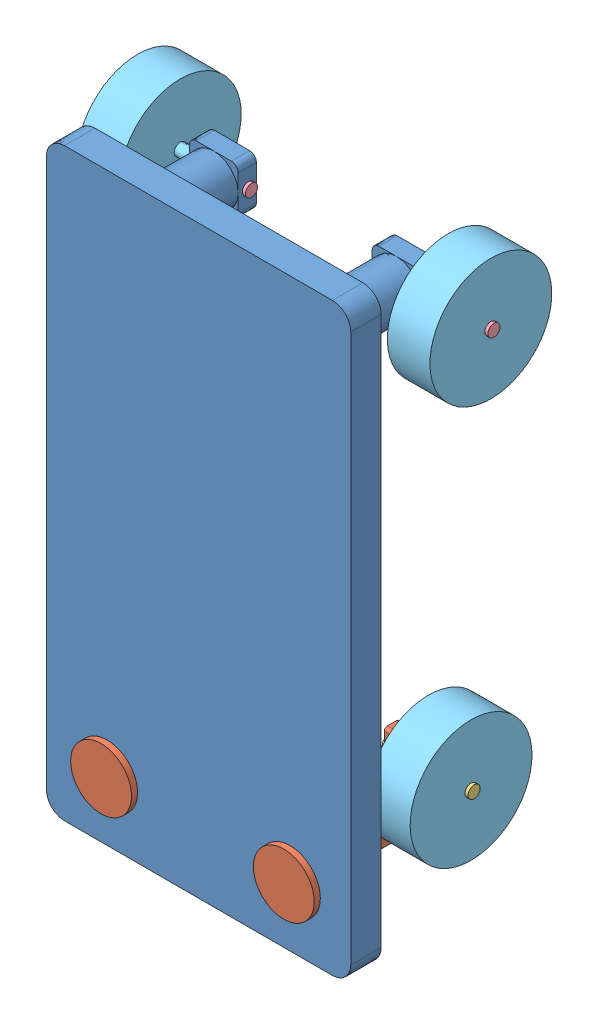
SolidWorks assembly Assem1.sldasm, configuration Default (file format 14000). Lengths in mm.
Overall size (590 983.66 369.11).
11 component instances, 5 part files, 24 mates.
Components (placement in the parent):
- chassis-1: chassis.SLDPRT [Default] at (10.6244 477.7519 0) x (-1 0 0) z (0 0 -1) size (500 960 205)
- castor-1: castor.SLDPRT [Default] at (160.6244 -326.9365 -20) x (-1 0 0) z (0 0 -1) size (100 175 205)
- pin castor-1: pin castor.SLDPRT [Default] at (-118.3756 -231.9365 -182.5) x (0 -0.904454 0.426572) z (-1 0 0) size (20 20 141)
- pin wheel-1: pin wheel.SLDPRT [Default] at (-284.3756 433.0635 -190) x (0 -0.610426 -0.792073) z (1 0 0) size (20 20 192)
- castor-2: castor.SLDPRT [Default] at (-139.3756 -326.9365 -20) x (-1 0 0) z (0 0 -1) size (100 175 205)
- pin castor-2: pin castor.SLDPRT [Default] at (139.6244 -231.9365 -182.5) x (0 -0.868219 -0.496182) z (1 0 0) size (20 20 141)
- castor wheel-2: castor wheel.SLDPRT [Default] at (-154.3756 -231.9365 -182.5) x (0 -0.500109 -0.865962) z (-1 0 0) size (200 200 100)
- castor wheel-3: castor wheel.SLDPRT [Default] at (175.6244 -231.9365 -182.5) x (0 0.893608 -0.448847) z (1 0 0) size (200 200 100)
- castor wheel-4: castor wheel.SLDPRT [Default] at (-179.3756 433.0635 -190) x (0 -0.112697 0.993629) z (-1 0 0) size (200 200 100)
- castor wheel-5: castor wheel.SLDPRT [Default] at (200.6244 433.0635 -190) x (0 -0.96137 -0.275259) z (1 0 0) size (200 200 100)
- pin wheel-2: pin wheel.SLDPRT [Default] at (113.6244 433.0635 -190) x (0 0.999916 -0.012975) z (1 0 0) size (20 20 192)
Mates (geometry in assembly coordinates):
- Perpendicular3: perpendicular: plane of chassis-1 through (10.6244 477.7519 0) normal (0 0 1)
- Parallel1: parallel aligned: plane of chassis-1 through (260.6244 -326.9365 -50) normal (1 0 0)
- Coincident2: coincident: plane of chassis-1 through (10.6244 477.7519 0) normal (0 0 1)
- Parallel2: parallel anti-aligned: plane of chassis-1 through (260.6244 -426.9365 -50) normal (0 -1 0)
- Concentric1: concentric anti-aligned: circle of chassis-1; circle of castor-2
- Concentric2: concentric anti-aligned: circle of chassis-1; circle of castor-1
- Coincident3: coincident anti-aligned: plane of chassis-1 through (10.6244 477.7519 0) normal (0 0 1); plane of castor-2 through (-139.3756 -326.9365 0) normal (0 0 -1)
- Coincident4: coincident anti-aligned: plane of chassis-1 through (10.6244 477.7519 0) normal (0 0 1); plane of castor-1 through (160.6244 -326.9365 0) normal (0 0 -1)
- Concentric4: concentric anti-aligned: circle of castor-2; circle of castor wheel-2
- Coincident6: coincident anti-aligned: plane of castor-2 through (-154.3756 -311.9365 -170) normal (-1 0 0); plane of castor wheel-2 through (-154.3756 -231.9365 -182.5) normal (1 0 0)
- Concentric5: concentric aligned: circle of castor-1; circle of castor wheel-3
- Coincident7: coincident anti-aligned: plane of castor-1 through (175.6244 -311.9365 -170) normal (1 0 0); plane of castor wheel-3 through (175.6244 -231.9365 -182.5) normal (-1 0 0)
- Concentric6: concentric aligned: circle of chassis-1; circle of castor wheel-5
- Coincident8: coincident anti-aligned: plane of chassis-1 through (200.6244 473.0635 -205) normal (1 0 0); plane of castor wheel-5 through (200.6244 433.0635 -190) normal (-1 0 0)
- Concentric7: concentric aligned: circle of chassis-1; circle of castor wheel-4
- Coincident9: coincident anti-aligned: plane of chassis-1 through (-179.3756 473.0635 -205) normal (-1 0 0); plane of castor wheel-4 through (-179.3756 433.0635 -190) normal (1 0 0)
- Concentric8: concentric anti-aligned: circle of pin castor-1; circle of castor-2
- Coincident10: coincident anti-aligned: plane of pin castor-1 through (-254.3756 -231.9365 -182.5) normal (1 0 0); plane of castor wheel-2 through (-254.3756 -231.9365 -182.5) normal (-1 0 0)
- Concentric11: concentric aligned: circle of pin castor-2; circle of castor wheel-3
- Coincident12: coincident anti-aligned: plane of pin castor-2 through (275.6244 -231.9365 -182.5) normal (-1 0 0); plane of castor wheel-3 through (275.6244 -231.9365 -182.5) normal (1 0 0)
- Concentric12: concentric aligned: circle of castor wheel-5; circle of pin wheel-2
- Coincident13: coincident anti-aligned: plane of castor wheel-5 through (300.6244 433.0635 -190) normal (1 0 0); plane of pin wheel-2 through (300.6244 433.0635 -190) normal (-1 0 0)
- Concentric13: concentric anti-aligned: circle of pin wheel-1; circle of castor wheel-4
- Coincident14: coincident anti-aligned: circle of pin wheel-1; plane of castor wheel-4 through (-279.3756 433.0635 -190) normal (-1 0 0)
